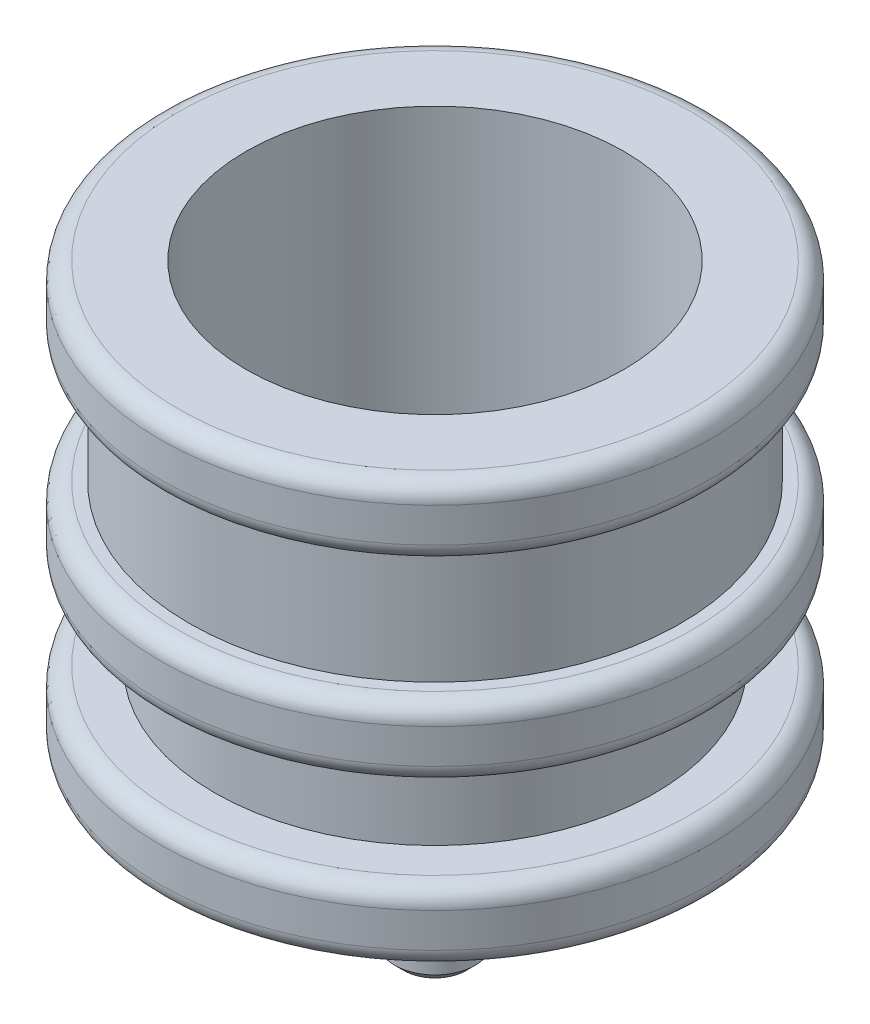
ISO-10303-21;
HEADER;
FILE_DESCRIPTION(('STEP AP214'),'2;1');
FILE_NAME('part.step','',(''),(''),'','','');
FILE_SCHEMA(('AUTOMOTIVE_DESIGN { 1 0 10303 214 1 1 1 1 }'));
ENDSEC;
DATA;
#1=APPLICATION_CONTEXT('core data for automotive mechanical design processes');
#2=APPLICATION_PROTOCOL_DEFINITION('international standard','automotive_design',2000,#1);
#3=PRODUCT_CONTEXT('',#1,'mechanical');
#4=PRODUCT('Part','Part','',(#3));
#5=PRODUCT_RELATED_PRODUCT_CATEGORY('part','',(#4));
#6=PRODUCT_DEFINITION_FORMATION('','',#4);
#7=PRODUCT_DEFINITION_CONTEXT('part definition',#1,'design');
#8=PRODUCT_DEFINITION('design','',#6,#7);
#9=PRODUCT_DEFINITION_SHAPE('','',#8);
#10=(LENGTH_UNIT() NAMED_UNIT(*) SI_UNIT(.MILLI.,.METRE.));
#11=(NAMED_UNIT(*) PLANE_ANGLE_UNIT() SI_UNIT($,.RADIAN.));
#12=(NAMED_UNIT(*) SI_UNIT($,.STERADIAN.) SOLID_ANGLE_UNIT());
#13=UNCERTAINTY_MEASURE_WITH_UNIT(LENGTH_MEASURE(1.E-05),#10,'distance_accuracy_value','');
#14=(GEOMETRIC_REPRESENTATION_CONTEXT(3) GLOBAL_UNCERTAINTY_ASSIGNED_CONTEXT((#13)) GLOBAL_UNIT_ASSIGNED_CONTEXT((#10,
#11,#12)) REPRESENTATION_CONTEXT('',''));
#15=CARTESIAN_POINT('',(0.,0.,0.));
#16=DIRECTION('',(0.,0.,1.));
#17=DIRECTION('',(1.,0.,0.));
#18=AXIS2_PLACEMENT_3D('',#15,#16,#17);
#19=CARTESIAN_POINT('',(0.,0.,0.));
#20=DIRECTION('',(0.,1.,0.));
#21=DIRECTION('',(0.,0.,1.));
#22=AXIS2_PLACEMENT_3D('',#19,#20,#21);
#23=PLANE('',#22);
#24=CARTESIAN_POINT('',(0.,0.,0.));
#25=DIRECTION('',(0.,1.,0.));
#26=DIRECTION('',(0.,0.,1.));
#27=AXIS2_PLACEMENT_3D('',#24,#25,#26);
#28=CIRCLE('',#27,3.66100000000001);
#29=CARTESIAN_POINT('',(0.,0.,3.66100000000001));
#30=VERTEX_POINT('',#29);
#31=EDGE_CURVE('E76',#30,#30,#28,.F.);
#32=ORIENTED_EDGE('',*,*,#31,.T.);
#33=EDGE_LOOP('',(#32));
#34=FACE_BOUND('',#33,.T.);
#35=CARTESIAN_POINT('',(0.,0.,0.));
#36=DIRECTION('',(0.,1.,0.));
#37=DIRECTION('',(0.,0.,1.));
#38=AXIS2_PLACEMENT_3D('',#35,#36,#37);
#39=CIRCLE('',#38,0.5715);
#40=CARTESIAN_POINT('',(0.,0.,0.5715));
#41=VERTEX_POINT('',#40);
#42=EDGE_CURVE('E43',#41,#41,#39,.F.);
#43=ORIENTED_EDGE('',*,*,#42,.F.);
#44=EDGE_LOOP('',(#43));
#45=FACE_BOUND('',#44,.T.);
#46=ADVANCED_FACE('F32',(#34,#45),#23,.F.);
#47=CARTESIAN_POINT('',(0.,11.0481009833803,0.));
#48=DIRECTION('',(0.,1.,0.));
#49=DIRECTION('',(0.,0.,1.));
#50=AXIS2_PLACEMENT_3D('',#47,#48,#49);
#51=CYLINDRICAL_SURFACE('',#50,3.91500000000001);
#52=CARTESIAN_POINT('',(0.,0.254000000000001,0.));
#53=DIRECTION('',(0.,1.,0.));
#54=DIRECTION('',(0.,0.,1.));
#55=AXIS2_PLACEMENT_3D('',#52,#53,#54);
#56=CIRCLE('',#55,3.91500000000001);
#57=CARTESIAN_POINT('',(0.,0.254000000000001,3.91500000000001));
#58=VERTEX_POINT('',#57);
#59=EDGE_CURVE('E79',#58,#58,#56,.T.);
#60=ORIENTED_EDGE('',*,*,#59,.T.);
#61=EDGE_LOOP('',(#60));
#62=FACE_BOUND('',#61,.T.);
#63=CARTESIAN_POINT('',(0.,0.746,0.));
#64=DIRECTION('',(0.,-1.,0.));
#65=DIRECTION('',(0.,0.,-1.));
#66=AXIS2_PLACEMENT_3D('',#63,#64,#65);
#67=CIRCLE('',#66,3.91500000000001);
#68=CARTESIAN_POINT('',(0.,0.746,-3.91500000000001));
#69=VERTEX_POINT('',#68);
#70=EDGE_CURVE('E82',#69,#69,#67,.T.);
#71=ORIENTED_EDGE('',*,*,#70,.T.);
#72=EDGE_LOOP('',(#71));
#73=FACE_BOUND('',#72,.T.);
#74=ADVANCED_FACE('F124',(#62,#73),#51,.T.);
#75=CARTESIAN_POINT('',(3.91500000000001,1.,0.));
#76=DIRECTION('',(0.,-1.,0.));
#77=DIRECTION('',(0.,0.,-1.));
#78=AXIS2_PLACEMENT_3D('',#75,#76,#77);
#79=PLANE('',#78);
#80=CARTESIAN_POINT('',(0.,1.,0.));
#81=DIRECTION('',(0.,-1.,0.));
#82=DIRECTION('',(0.,0.,-1.));
#83=AXIS2_PLACEMENT_3D('',#80,#81,#82);
#84=CIRCLE('',#83,3.66100000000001);
#85=CARTESIAN_POINT('',(0.,1.,-3.66100000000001));
#86=VERTEX_POINT('',#85);
#87=EDGE_CURVE('E73',#86,#86,#84,.F.);
#88=ORIENTED_EDGE('',*,*,#87,.T.);
#89=EDGE_LOOP('',(#88));
#90=FACE_BOUND('',#89,.T.);
#91=CARTESIAN_POINT('',(0.,1.,0.));
#92=DIRECTION('',(0.,1.,0.));
#93=DIRECTION('',(0.,0.,1.));
#94=AXIS2_PLACEMENT_3D('',#91,#92,#93);
#95=CIRCLE('',#94,3.14000000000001);
#96=CARTESIAN_POINT('',(0.,1.,3.14000000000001));
#97=VERTEX_POINT('',#96);
#98=EDGE_CURVE('E85',#97,#97,#95,.T.);
#99=ORIENTED_EDGE('',*,*,#98,.F.);
#100=EDGE_LOOP('',(#99));
#101=FACE_BOUND('',#100,.T.);
#102=ADVANCED_FACE('F130',(#90,#101),#79,.F.);
#103=CARTESIAN_POINT('',(0.,11.0481009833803,0.));
#104=DIRECTION('',(0.,1.,0.));
#105=DIRECTION('',(0.,0.,1.));
#106=AXIS2_PLACEMENT_3D('',#103,#104,#105);
#107=CYLINDRICAL_SURFACE('',#106,3.14000000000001);
#108=CARTESIAN_POINT('',(0.,2.27,0.));
#109=DIRECTION('',(0.,1.,0.));
#110=DIRECTION('',(0.,0.,1.));
#111=AXIS2_PLACEMENT_3D('',#108,#109,#110);
#112=CIRCLE('',#111,3.14000000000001);
#113=CARTESIAN_POINT('',(0.,2.27,3.14000000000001));
#114=VERTEX_POINT('',#113);
#115=EDGE_CURVE('E88',#114,#114,#112,.T.);
#116=ORIENTED_EDGE('',*,*,#115,.F.);
#117=EDGE_LOOP('',(#116));
#118=FACE_BOUND('',#117,.T.);
#119=ORIENTED_EDGE('',*,*,#98,.T.);
#120=EDGE_LOOP('',(#119));
#121=FACE_BOUND('',#120,.T.);
#122=ADVANCED_FACE('F297',(#118,#121),#107,.T.);
#123=CARTESIAN_POINT('',(3.14000000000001,2.27,0.));
#124=DIRECTION('',(0.,1.,0.));
#125=DIRECTION('',(0.,0.,1.));
#126=AXIS2_PLACEMENT_3D('',#123,#124,#125);
#127=PLANE('',#126);
#128=CARTESIAN_POINT('',(0.,2.27,0.));
#129=DIRECTION('',(0.,1.,0.));
#130=DIRECTION('',(0.,0.,1.));
#131=AXIS2_PLACEMENT_3D('',#128,#129,#130);
#132=CIRCLE('',#131,3.66100000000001);
#133=CARTESIAN_POINT('',(0.,2.27,3.66100000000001));
#134=VERTEX_POINT('',#133);
#135=EDGE_CURVE('E64',#134,#134,#132,.F.);
#136=ORIENTED_EDGE('',*,*,#135,.T.);
#137=EDGE_LOOP('',(#136));
#138=FACE_BOUND('',#137,.T.);
#139=ORIENTED_EDGE('',*,*,#115,.T.);
#140=EDGE_LOOP('',(#139));
#141=FACE_BOUND('',#140,.T.);
#142=ADVANCED_FACE('F288',(#138,#141),#127,.F.);
#143=CARTESIAN_POINT('',(0.,11.0481009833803,0.));
#144=DIRECTION('',(0.,1.,0.));
#145=DIRECTION('',(0.,0.,1.));
#146=AXIS2_PLACEMENT_3D('',#143,#144,#145);
#147=CYLINDRICAL_SURFACE('',#146,3.91500000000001);
#148=CARTESIAN_POINT('',(0.,2.524,0.));
#149=DIRECTION('',(0.,1.,0.));
#150=DIRECTION('',(0.,0.,1.));
#151=AXIS2_PLACEMENT_3D('',#148,#149,#150);
#152=CIRCLE('',#151,3.91500000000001);
#153=CARTESIAN_POINT('',(0.,2.524,3.91500000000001));
#154=VERTEX_POINT('',#153);
#155=EDGE_CURVE('E67',#154,#154,#152,.T.);
#156=ORIENTED_EDGE('',*,*,#155,.T.);
#157=EDGE_LOOP('',(#156));
#158=FACE_BOUND('',#157,.T.);
#159=CARTESIAN_POINT('',(0.,3.016,0.));
#160=DIRECTION('',(0.,-1.,0.));
#161=DIRECTION('',(0.,0.,-1.));
#162=AXIS2_PLACEMENT_3D('',#159,#160,#161);
#163=CIRCLE('',#162,3.91500000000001);
#164=CARTESIAN_POINT('',(0.,3.016,-3.91500000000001));
#165=VERTEX_POINT('',#164);
#166=EDGE_CURVE('E70',#165,#165,#163,.T.);
#167=ORIENTED_EDGE('',*,*,#166,.T.);
#168=EDGE_LOOP('',(#167));
#169=FACE_BOUND('',#168,.T.);
#170=ADVANCED_FACE('F279',(#158,#169),#147,.T.);
#171=CARTESIAN_POINT('',(3.5,3.27,0.));
#172=DIRECTION('',(0.,-1.,0.));
#173=DIRECTION('',(0.,0.,-1.));
#174=AXIS2_PLACEMENT_3D('',#171,#172,#173);
#175=PLANE('',#174);
#176=CARTESIAN_POINT('',(0.,3.27,0.));
#177=DIRECTION('',(0.,-1.,0.));
#178=DIRECTION('',(0.,0.,-1.));
#179=AXIS2_PLACEMENT_3D('',#176,#177,#178);
#180=CIRCLE('',#179,3.66100000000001);
#181=CARTESIAN_POINT('',(0.,3.27,-3.66100000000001));
#182=VERTEX_POINT('',#181);
#183=EDGE_CURVE('E61',#182,#182,#180,.F.);
#184=ORIENTED_EDGE('',*,*,#183,.T.);
#185=EDGE_LOOP('',(#184));
#186=FACE_BOUND('',#185,.T.);
#187=CARTESIAN_POINT('',(0.,3.27,0.));
#188=DIRECTION('',(0.,1.,0.));
#189=DIRECTION('',(0.,0.,1.));
#190=AXIS2_PLACEMENT_3D('',#187,#188,#189);
#191=CIRCLE('',#190,3.5);
#192=CARTESIAN_POINT('',(0.,3.27,3.5));
#193=VERTEX_POINT('',#192);
#194=EDGE_CURVE('E91',#193,#193,#191,.T.);
#195=ORIENTED_EDGE('',*,*,#194,.F.);
#196=EDGE_LOOP('',(#195));
#197=FACE_BOUND('',#196,.T.);
#198=ADVANCED_FACE('F270',(#186,#197),#175,.F.);
#199=CARTESIAN_POINT('',(0.,11.0481009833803,0.));
#200=DIRECTION('',(0.,1.,0.));
#201=DIRECTION('',(0.,0.,1.));
#202=AXIS2_PLACEMENT_3D('',#199,#200,#201);
#203=CYLINDRICAL_SURFACE('',#202,3.5);
#204=CARTESIAN_POINT('',(0.,5.,0.));
#205=DIRECTION('',(0.,1.,0.));
#206=DIRECTION('',(0.,0.,1.));
#207=AXIS2_PLACEMENT_3D('',#204,#205,#206);
#208=CIRCLE('',#207,3.5);
#209=CARTESIAN_POINT('',(0.,5.,3.5));
#210=VERTEX_POINT('',#209);
#211=EDGE_CURVE('E94',#210,#210,#208,.T.);
#212=ORIENTED_EDGE('',*,*,#211,.F.);
#213=EDGE_LOOP('',(#212));
#214=FACE_BOUND('',#213,.T.);
#215=ORIENTED_EDGE('',*,*,#194,.T.);
#216=EDGE_LOOP('',(#215));
#217=FACE_BOUND('',#216,.T.);
#218=ADVANCED_FACE('F261',(#214,#217),#203,.T.);
#219=CARTESIAN_POINT('',(3.91500000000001,5.,0.));
#220=DIRECTION('',(0.,1.,0.));
#221=DIRECTION('',(0.,0.,1.));
#222=AXIS2_PLACEMENT_3D('',#219,#220,#221);
#223=PLANE('',#222);
#224=CARTESIAN_POINT('',(0.,5.,0.));
#225=DIRECTION('',(0.,1.,0.));
#226=DIRECTION('',(0.,0.,1.));
#227=AXIS2_PLACEMENT_3D('',#224,#225,#226);
#228=CIRCLE('',#227,3.66100000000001);
#229=CARTESIAN_POINT('',(0.,5.,3.66100000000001));
#230=VERTEX_POINT('',#229);
#231=EDGE_CURVE('E52',#230,#230,#228,.F.);
#232=ORIENTED_EDGE('',*,*,#231,.T.);
#233=EDGE_LOOP('',(#232));
#234=FACE_BOUND('',#233,.T.);
#235=ORIENTED_EDGE('',*,*,#211,.T.);
#236=EDGE_LOOP('',(#235));
#237=FACE_BOUND('',#236,.T.);
#238=ADVANCED_FACE('F120',(#234,#237),#223,.F.);
#239=CARTESIAN_POINT('',(0.,11.0481009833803,0.));
#240=DIRECTION('',(0.,1.,0.));
#241=DIRECTION('',(0.,0.,1.));
#242=AXIS2_PLACEMENT_3D('',#239,#240,#241);
#243=CYLINDRICAL_SURFACE('',#242,3.91500000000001);
#244=CARTESIAN_POINT('',(0.,5.254,0.));
#245=DIRECTION('',(0.,1.,0.));
#246=DIRECTION('',(0.,0.,1.));
#247=AXIS2_PLACEMENT_3D('',#244,#245,#246);
#248=CIRCLE('',#247,3.91500000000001);
#249=CARTESIAN_POINT('',(0.,5.254,3.91500000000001));
#250=VERTEX_POINT('',#249);
#251=EDGE_CURVE('E55',#250,#250,#248,.T.);
#252=ORIENTED_EDGE('',*,*,#251,.T.);
#253=EDGE_LOOP('',(#252));
#254=FACE_BOUND('',#253,.T.);
#255=CARTESIAN_POINT('',(0.,5.746,0.));
#256=DIRECTION('',(0.,-1.,0.));
#257=DIRECTION('',(0.,0.,-1.));
#258=AXIS2_PLACEMENT_3D('',#255,#256,#257);
#259=CIRCLE('',#258,3.91500000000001);
#260=CARTESIAN_POINT('',(0.,5.746,-3.91500000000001));
#261=VERTEX_POINT('',#260);
#262=EDGE_CURVE('E58',#261,#261,#259,.T.);
#263=ORIENTED_EDGE('',*,*,#262,.T.);
#264=EDGE_LOOP('',(#263));
#265=FACE_BOUND('',#264,.T.);
#266=ADVANCED_FACE('F114',(#254,#265),#243,.T.);
#267=CARTESIAN_POINT('',(3.91500000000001,6.,0.));
#268=DIRECTION('',(0.,-1.,0.));
#269=DIRECTION('',(0.,0.,-1.));
#270=AXIS2_PLACEMENT_3D('',#267,#268,#269);
#271=PLANE('',#270);
#272=CARTESIAN_POINT('',(0.,6.,0.));
#273=DIRECTION('',(0.,-1.,0.));
#274=DIRECTION('',(0.,0.,-1.));
#275=AXIS2_PLACEMENT_3D('',#272,#273,#274);
#276=CIRCLE('',#275,3.66100000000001);
#277=CARTESIAN_POINT('',(0.,6.,-3.66100000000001));
#278=VERTEX_POINT('',#277);
#279=EDGE_CURVE('E47',#278,#278,#276,.F.);
#280=ORIENTED_EDGE('',*,*,#279,.T.);
#281=EDGE_LOOP('',(#280));
#282=FACE_BOUND('',#281,.T.);
#283=CARTESIAN_POINT('',(0.,6.,0.));
#284=DIRECTION('',(0.,1.,0.));
#285=DIRECTION('',(0.,0.,1.));
#286=AXIS2_PLACEMENT_3D('',#283,#284,#285);
#287=CIRCLE('',#286,2.6924);
#288=CARTESIAN_POINT('',(0.,6.,2.6924));
#289=VERTEX_POINT('',#288);
#290=EDGE_CURVE('E98',#289,#289,#287,.T.);
#291=ORIENTED_EDGE('',*,*,#290,.F.);
#292=EDGE_LOOP('',(#291));
#293=FACE_BOUND('',#292,.T.);
#294=ADVANCED_FACE('F109',(#282,#293),#271,.F.);
#295=CARTESIAN_POINT('',(0.,1.500009,0.));
#296=DIRECTION('',(0.,1.,0.));
#297=DIRECTION('',(0.,0.,1.));
#298=AXIS2_PLACEMENT_3D('',#295,#296,#297);
#299=CYLINDRICAL_SURFACE('',#298,2.6924);
#300=CARTESIAN_POINT('',(0.,1.500009,0.));
#301=DIRECTION('',(0.,1.,0.));
#302=DIRECTION('',(0.,0.,1.));
#303=AXIS2_PLACEMENT_3D('',#300,#301,#302);
#304=CIRCLE('',#303,2.6924);
#305=CARTESIAN_POINT('',(0.,1.500009,2.6924));
#306=VERTEX_POINT('',#305);
#307=EDGE_CURVE('E97',#306,#306,#304,.T.);
#308=ORIENTED_EDGE('',*,*,#307,.F.);
#309=EDGE_LOOP('',(#308));
#310=FACE_BOUND('',#309,.T.);
#311=ORIENTED_EDGE('',*,*,#290,.T.);
#312=EDGE_LOOP('',(#311));
#313=FACE_BOUND('',#312,.T.);
#314=ADVANCED_FACE('F106',(#310,#313),#299,.F.);
#315=CARTESIAN_POINT('',(0.,1.500009,0.));
#316=DIRECTION('',(0.,1.,0.));
#317=DIRECTION('',(0.,0.,1.));
#318=AXIS2_PLACEMENT_3D('',#315,#316,#317);
#319=PLANE('',#318);
#320=ORIENTED_EDGE('',*,*,#307,.T.);
#321=EDGE_LOOP('',(#320));
#322=FACE_BOUND('',#321,.T.);
#323=ADVANCED_FACE('F104',(#322),#319,.T.);
#324=CARTESIAN_POINT('',(0.,0.254000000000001,0.));
#325=DIRECTION('',(0.,1.,0.));
#326=DIRECTION('',(0.,0.,1.));
#327=AXIS2_PLACEMENT_3D('',#324,#325,#326);
#328=TOROIDAL_SURFACE('',#327,3.66100000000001,0.254);
#329=ORIENTED_EDGE('',*,*,#31,.F.);
#330=EDGE_LOOP('',(#329));
#331=FACE_BOUND('',#330,.T.);
#332=ORIENTED_EDGE('',*,*,#59,.F.);
#333=EDGE_LOOP('',(#332));
#334=FACE_BOUND('',#333,.T.);
#335=ADVANCED_FACE('F136',(#331,#334),#328,.T.);
#336=CARTESIAN_POINT('',(0.,0.746,0.));
#337=DIRECTION('',(0.,-1.,0.));
#338=DIRECTION('',(0.,0.,-1.));
#339=AXIS2_PLACEMENT_3D('',#336,#337,#338);
#340=TOROIDAL_SURFACE('',#339,3.66100000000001,0.254);
#341=ORIENTED_EDGE('',*,*,#70,.F.);
#342=EDGE_LOOP('',(#341));
#343=FACE_BOUND('',#342,.T.);
#344=ORIENTED_EDGE('',*,*,#87,.F.);
#345=EDGE_LOOP('',(#344));
#346=FACE_BOUND('',#345,.T.);
#347=ADVANCED_FACE('F139',(#343,#346),#340,.T.);
#348=CARTESIAN_POINT('',(0.,2.524,0.));
#349=DIRECTION('',(0.,1.,0.));
#350=DIRECTION('',(0.,0.,1.));
#351=AXIS2_PLACEMENT_3D('',#348,#349,#350);
#352=TOROIDAL_SURFACE('',#351,3.66100000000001,0.254);
#353=ORIENTED_EDGE('',*,*,#135,.F.);
#354=EDGE_LOOP('',(#353));
#355=FACE_BOUND('',#354,.T.);
#356=ORIENTED_EDGE('',*,*,#155,.F.);
#357=EDGE_LOOP('',(#356));
#358=FACE_BOUND('',#357,.T.);
#359=ADVANCED_FACE('F143',(#355,#358),#352,.T.);
#360=CARTESIAN_POINT('',(0.,3.016,0.));
#361=DIRECTION('',(0.,-1.,0.));
#362=DIRECTION('',(0.,0.,-1.));
#363=AXIS2_PLACEMENT_3D('',#360,#361,#362);
#364=TOROIDAL_SURFACE('',#363,3.66100000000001,0.254);
#365=ORIENTED_EDGE('',*,*,#166,.F.);
#366=EDGE_LOOP('',(#365));
#367=FACE_BOUND('',#366,.T.);
#368=ORIENTED_EDGE('',*,*,#183,.F.);
#369=EDGE_LOOP('',(#368));
#370=FACE_BOUND('',#369,.T.);
#371=ADVANCED_FACE('F147',(#367,#370),#364,.T.);
#372=CARTESIAN_POINT('',(0.,5.254,0.));
#373=DIRECTION('',(0.,1.,0.));
#374=DIRECTION('',(0.,0.,1.));
#375=AXIS2_PLACEMENT_3D('',#372,#373,#374);
#376=TOROIDAL_SURFACE('',#375,3.66100000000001,0.254);
#377=ORIENTED_EDGE('',*,*,#231,.F.);
#378=EDGE_LOOP('',(#377));
#379=FACE_BOUND('',#378,.T.);
#380=ORIENTED_EDGE('',*,*,#251,.F.);
#381=EDGE_LOOP('',(#380));
#382=FACE_BOUND('',#381,.T.);
#383=ADVANCED_FACE('F151',(#379,#382),#376,.T.);
#384=CARTESIAN_POINT('',(0.,5.746,0.));
#385=DIRECTION('',(0.,-1.,0.));
#386=DIRECTION('',(0.,0.,-1.));
#387=AXIS2_PLACEMENT_3D('',#384,#385,#386);
#388=TOROIDAL_SURFACE('',#387,3.66100000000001,0.254);
#389=ORIENTED_EDGE('',*,*,#262,.F.);
#390=EDGE_LOOP('',(#389));
#391=FACE_BOUND('',#390,.T.);
#392=ORIENTED_EDGE('',*,*,#279,.F.);
#393=EDGE_LOOP('',(#392));
#394=FACE_BOUND('',#393,.T.);
#395=ADVANCED_FACE('F154',(#391,#394),#388,.T.);
#396=CARTESIAN_POINT('',(0.,-2.54,0.));
#397=DIRECTION('',(0.,1.,0.));
#398=DIRECTION('',(0.,0.,1.));
#399=AXIS2_PLACEMENT_3D('',#396,#397,#398);
#400=CYLINDRICAL_SURFACE('',#399,0.5715);
#401=CARTESIAN_POINT('',(0.,-2.413,0.));
#402=DIRECTION('',(0.,-1.,0.));
#403=DIRECTION('',(0.,0.,-1.));
#404=AXIS2_PLACEMENT_3D('',#401,#402,#403);
#405=CIRCLE('',#404,0.5715);
#406=CARTESIAN_POINT('',(0.,-2.413,-0.5715));
#407=VERTEX_POINT('',#406);
#408=EDGE_CURVE('E10',#407,#407,#405,.F.);
#409=ORIENTED_EDGE('',*,*,#408,.T.);
#410=EDGE_LOOP('',(#409));
#411=FACE_BOUND('',#410,.T.);
#412=ORIENTED_EDGE('',*,*,#42,.T.);
#413=EDGE_LOOP('',(#412));
#414=FACE_BOUND('',#413,.T.);
#415=ADVANCED_FACE('F157',(#411,#414),#400,.T.);
#416=CARTESIAN_POINT('',(0.,-2.54,0.));
#417=DIRECTION('',(0.,-1.,0.));
#418=DIRECTION('',(0.,0.,-1.));
#419=AXIS2_PLACEMENT_3D('',#416,#417,#418);
#420=PLANE('',#419);
#421=CARTESIAN_POINT('',(0.,-2.54,0.));
#422=DIRECTION('',(0.,-1.,0.));
#423=DIRECTION('',(0.,0.,-1.));
#424=AXIS2_PLACEMENT_3D('',#421,#422,#423);
#425=CIRCLE('',#424,0.4445);
#426=CARTESIAN_POINT('',(0.,-2.54,-0.4445));
#427=VERTEX_POINT('',#426);
#428=EDGE_CURVE('E39',#427,#427,#425,.T.);
#429=ORIENTED_EDGE('',*,*,#428,.T.);
#430=EDGE_LOOP('',(#429));
#431=FACE_BOUND('',#430,.T.);
#432=ADVANCED_FACE('F162',(#431),#420,.T.);
#433=CARTESIAN_POINT('',(0.,-2.54,0.));
#434=DIRECTION('',(0.,1.,0.));
#435=DIRECTION('',(0.,0.,1.));
#436=AXIS2_PLACEMENT_3D('',#433,#434,#435);
#437=CONICAL_SURFACE('',#436,0.4445,0.785398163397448);
#438=ORIENTED_EDGE('',*,*,#408,.F.);
#439=EDGE_LOOP('',(#438));
#440=FACE_BOUND('',#439,.T.);
#441=ORIENTED_EDGE('',*,*,#428,.F.);
#442=EDGE_LOOP('',(#441));
#443=FACE_BOUND('',#442,.T.);
#444=ADVANCED_FACE('F34',(#440,#443),#437,.T.);
#445=CLOSED_SHELL('',(#46,#74,#102,#122,#142,#170,#198,#218,#238,#266,#294,#314,#323,#335,#347,
#359,#371,#383,#395,#415,#432,#444));
#446=MANIFOLD_SOLID_BREP('B2',#445);
#447=ADVANCED_BREP_SHAPE_REPRESENTATION('',(#18,#446),#14);
#448=SHAPE_DEFINITION_REPRESENTATION(#9,#447);
ENDSEC;
END-ISO-10303-21;
